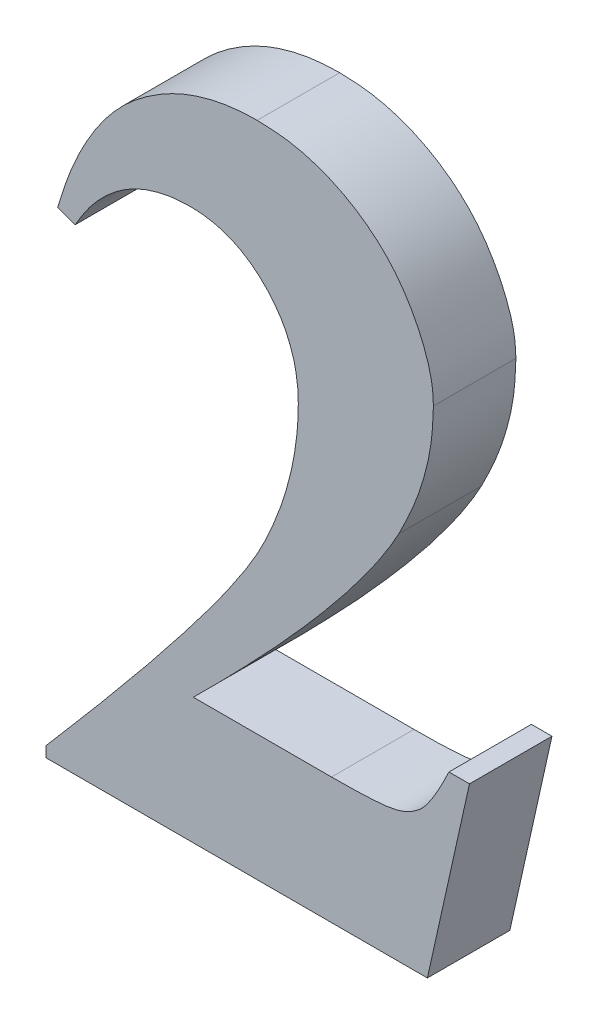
ISO-10303-21;
HEADER;
FILE_DESCRIPTION(('STEP AP214'),'2;1');
FILE_NAME('part.step','',(''),(''),'','','');
FILE_SCHEMA(('AUTOMOTIVE_DESIGN { 1 0 10303 214 1 1 1 1 }'));
ENDSEC;
DATA;
#1=APPLICATION_CONTEXT('core data for automotive mechanical design processes');
#2=APPLICATION_PROTOCOL_DEFINITION('international standard','automotive_design',2000,#1);
#3=PRODUCT_CONTEXT('',#1,'mechanical');
#4=PRODUCT('Part','Part','',(#3));
#5=PRODUCT_RELATED_PRODUCT_CATEGORY('part','',(#4));
#6=PRODUCT_DEFINITION_FORMATION('','',#4);
#7=PRODUCT_DEFINITION_CONTEXT('part definition',#1,'design');
#8=PRODUCT_DEFINITION('design','',#6,#7);
#9=PRODUCT_DEFINITION_SHAPE('','',#8);
#10=(LENGTH_UNIT() NAMED_UNIT(*) SI_UNIT(.MILLI.,.METRE.));
#11=(NAMED_UNIT(*) PLANE_ANGLE_UNIT() SI_UNIT($,.RADIAN.));
#12=(NAMED_UNIT(*) SI_UNIT($,.STERADIAN.) SOLID_ANGLE_UNIT());
#13=UNCERTAINTY_MEASURE_WITH_UNIT(LENGTH_MEASURE(1.E-05),#10,'distance_accuracy_value','');
#14=(GEOMETRIC_REPRESENTATION_CONTEXT(3) GLOBAL_UNCERTAINTY_ASSIGNED_CONTEXT((#13)) GLOBAL_UNIT_ASSIGNED_CONTEXT((#10,
#11,#12)) REPRESENTATION_CONTEXT('',''));
#15=CARTESIAN_POINT('',(0.,0.,0.));
#16=DIRECTION('',(0.,0.,1.));
#17=DIRECTION('',(1.,0.,0.));
#18=AXIS2_PLACEMENT_3D('',#15,#16,#17);
#19=CARTESIAN_POINT('',(-28.575,0.,-6.35));
#20=DIRECTION('',(0.,-1.,0.));
#21=DIRECTION('',(0.,0.,-1.));
#22=AXIS2_PLACEMENT_3D('',#19,#20,#21);
#23=PLANE('',#22);
#24=DIRECTION('',(0.,0.,1.));
#25=VECTOR('',#24,1.);
#26=CARTESIAN_POINT('',(2.16972041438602,0.,-6.35));
#27=LINE('',#26,#25);
#28=CARTESIAN_POINT('',(2.16972041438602,0.,-6.35));
#29=VERTEX_POINT('',#28);
#30=CARTESIAN_POINT('',(2.16972041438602,0.,0.));
#31=VERTEX_POINT('',#30);
#32=EDGE_CURVE('E131',#29,#31,#27,.T.);
#33=ORIENTED_EDGE('',*,*,#32,.T.);
#34=DIRECTION('',(1.,0.,0.));
#35=VECTOR('',#34,1.);
#36=CARTESIAN_POINT('',(-28.575,0.,0.));
#37=LINE('',#36,#35);
#38=CARTESIAN_POINT('',(-27.1878571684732,0.,0.));
#39=VERTEX_POINT('',#38);
#40=EDGE_CURVE('E36',#39,#31,#37,.T.);
#41=ORIENTED_EDGE('',*,*,#40,.F.);
#42=DIRECTION('',(0.,0.,1.));
#43=VECTOR('',#42,1.);
#44=CARTESIAN_POINT('',(-27.1878571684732,0.,-6.35));
#45=LINE('',#44,#43);
#46=CARTESIAN_POINT('',(-27.1878571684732,0.,-6.35));
#47=VERTEX_POINT('',#46);
#48=EDGE_CURVE('E144',#47,#39,#45,.T.);
#49=ORIENTED_EDGE('',*,*,#48,.F.);
#50=DIRECTION('',(1.,0.,0.));
#51=VECTOR('',#50,1.);
#52=CARTESIAN_POINT('',(-28.575,0.,-6.35));
#53=LINE('',#52,#51);
#54=EDGE_CURVE('E11',#47,#29,#53,.T.);
#55=ORIENTED_EDGE('',*,*,#54,.T.);
#56=EDGE_LOOP('',(#33,#41,#49,#55));
#57=FACE_BOUND('',#56,.T.);
#58=ADVANCED_FACE('F29',(#57),#23,.T.);
#59=CARTESIAN_POINT('',(-28.575,57.15,-6.35));
#60=DIRECTION('',(0.,0.,1.));
#61=DIRECTION('',(1.,0.,0.));
#62=AXIS2_PLACEMENT_3D('',#59,#60,#61);
#63=PLANE('',#62);
#64=DIRECTION('',(1.,0.,0.));
#65=VECTOR('',#64,1.);
#66=CARTESIAN_POINT('',(3.82778958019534,14.5649997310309,-6.35));
#67=LINE('',#66,#65);
#68=CARTESIAN_POINT('',(3.82778958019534,14.5649997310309,-6.35));
#69=VERTEX_POINT('',#68);
#70=CARTESIAN_POINT('',(5.40999937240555,14.5649997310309,-6.35));
#71=VERTEX_POINT('',#70);
#72=EDGE_CURVE('E174',#69,#71,#67,.T.);
#73=ORIENTED_EDGE('',*,*,#72,.T.);
#74=DIRECTION('',(-0.217161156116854,-0.976135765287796,0.));
#75=VECTOR('',#74,1.);
#76=CARTESIAN_POINT('',(5.40999937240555,14.5649997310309,-6.35));
#77=LINE('',#76,#75);
#78=EDGE_CURVE('E297',#71,#29,#77,.T.);
#79=ORIENTED_EDGE('',*,*,#78,.T.);
#80=ORIENTED_EDGE('',*,*,#54,.F.);
#81=DIRECTION('',(0.,1.,0.));
#82=VECTOR('',#81,1.);
#83=CARTESIAN_POINT('',(-27.1878571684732,0.,-6.35));
#84=LINE('',#83,#82);
#85=CARTESIAN_POINT('',(-27.1878571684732,0.812779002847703,-6.35));
#86=VERTEX_POINT('',#85);
#87=EDGE_CURVE('E300',#47,#86,#84,.T.);
#88=ORIENTED_EDGE('',*,*,#87,.T.);
#89=CARTESIAN_POINT('',(-27.1878571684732,0.812779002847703,-6.35));
#90=CARTESIAN_POINT('',(-26.6239457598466,1.46989620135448,-6.35));
#91=CARTESIAN_POINT('',(-25.5226560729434,2.75321195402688,-6.35));
#92=CARTESIAN_POINT('',(-23.9151617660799,4.63946114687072,-6.35));
#93=CARTESIAN_POINT('',(-22.4010764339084,6.44830604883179,-6.35));
#94=CARTESIAN_POINT('',(-20.9705572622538,8.17138959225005,-6.35));
#95=CARTESIAN_POINT('',(-19.6225294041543,9.80802042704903,-6.35));
#96=CARTESIAN_POINT('',(-18.3693298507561,11.3681607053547,-6.35));
#97=CARTESIAN_POINT('',(-17.1939883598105,12.8418172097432,-6.35));
#98=CARTESIAN_POINT('',(-16.1143963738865,14.2394748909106,-6.35));
#99=CARTESIAN_POINT('',(-15.1114901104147,15.5500996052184,-6.35));
#100=CARTESIAN_POINT('',(-14.2094766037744,16.7844955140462,-6.35));
#101=CARTESIAN_POINT('',(-13.372605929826,17.924008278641,-6.35));
#102=CARTESIAN_POINT('',(-12.6472391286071,18.9942571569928,-6.35));
#103=CARTESIAN_POINT('',(-11.9833837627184,19.9718561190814,-6.35));
#104=CARTESIAN_POINT('',(-11.4298463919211,20.8780577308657,-6.35));
#105=CARTESIAN_POINT('',(-10.9429017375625,21.692754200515,-6.35));
#106=CARTESIAN_POINT('',(-10.4295500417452,22.6691619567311,-6.35));
#107=CARTESIAN_POINT('',(-9.88741223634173,23.8341140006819,-6.35));
#108=CARTESIAN_POINT('',(-9.32117474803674,25.2112785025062,-6.35));
#109=CARTESIAN_POINT('',(-8.84073295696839,26.5815205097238,-6.35));
#110=CARTESIAN_POINT('',(-8.45122547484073,27.9459956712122,-6.35));
#111=CARTESIAN_POINT('',(-8.14571768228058,29.3027174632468,-6.35));
#112=CARTESIAN_POINT('',(-7.92928429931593,30.6489684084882,-6.35));
#113=CARTESIAN_POINT('',(-7.79290503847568,31.9881557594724,-6.35));
#114=CARTESIAN_POINT('',(-7.77619497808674,32.879302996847,-6.35));
#115=CARTESIAN_POINT('',(-7.76785752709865,33.3239391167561,-6.35));
#116=B_SPLINE_CURVE_WITH_KNOTS('',3,(#89,#90,#91,#92,#93,#94,#95,#96,#97,#98,#99,#100,#101,#102,
#103,#104,#105,#106,#107,#108,#109,#110,#111,#112,#113,#114,#115),.UNSPECIFIED.,.F.,.F.,(4,1,1,
1,1,1,1,1,1,1,1,1,1,1,1,1,1,1,1,1,1,1,1,1,4),(0.,0.0671915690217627,0.131221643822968,
0.19230578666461,0.250231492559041,0.305000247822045,0.356831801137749,0.405511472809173,
0.45126317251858,0.493870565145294,0.533563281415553,0.569896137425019,0.603562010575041,
0.633881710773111,0.661573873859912,0.685947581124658,0.707514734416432,0.747140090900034,
0.785607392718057,0.823017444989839,0.859749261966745,0.895655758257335,0.930862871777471,
0.965504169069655,1.),.UNSPECIFIED.);
#117=CARTESIAN_POINT('',(-7.76785752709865,33.3239391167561,-6.35));
#118=VERTEX_POINT('',#117);
#119=EDGE_CURVE('E303',#86,#118,#116,.T.);
#120=ORIENTED_EDGE('',*,*,#119,.T.);
#121=CARTESIAN_POINT('',(-7.76785752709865,33.3239391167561,-6.35));
#122=CARTESIAN_POINT('',(-7.77181152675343,33.6387144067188,-6.35));
#123=CARTESIAN_POINT('',(-7.77961348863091,34.2598234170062,-6.35));
#124=CARTESIAN_POINT('',(-7.90980681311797,35.1680345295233,-6.35));
#125=CARTESIAN_POINT('',(-8.08364680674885,36.042674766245,-6.35));
#126=CARTESIAN_POINT('',(-8.36284810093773,36.8661025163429,-6.35));
#127=CARTESIAN_POINT('',(-8.69603394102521,37.6528799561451,-6.35));
#128=CARTESIAN_POINT('',(-9.1124071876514,38.3988228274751,-6.35));
#129=CARTESIAN_POINT('',(-9.61297999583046,39.0979005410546,-6.35));
#130=CARTESIAN_POINT('',(-10.1712436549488,39.7580585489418,-6.35));
#131=CARTESIAN_POINT('',(-10.7878013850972,40.3497819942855,-6.35));
#132=CARTESIAN_POINT('',(-11.4410960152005,40.8770174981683,-6.35));
#133=CARTESIAN_POINT('',(-12.1320606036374,41.3193237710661,-6.35));
#134=CARTESIAN_POINT('',(-12.8583863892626,41.6828927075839,-6.35));
#135=CARTESIAN_POINT('',(-13.6137769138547,41.9646718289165,-6.35));
#136=CARTESIAN_POINT('',(-14.4067089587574,42.1597612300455,-6.35));
#137=CARTESIAN_POINT('',(-15.2308221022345,42.2814995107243,-6.35));
#138=CARTESIAN_POINT('',(-15.7940778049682,42.2989844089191,-6.35));
#139=CARTESIAN_POINT('',(-16.0798774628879,42.3078563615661,-6.35));
#140=B_SPLINE_CURVE_WITH_KNOTS('',3,(#121,#122,#123,#124,#125,#126,#127,#128,#129,#130,#131,
#132,#133,#134,#135,#136,#137,#138,#139),.UNSPECIFIED.,.F.,.F.,(4,1,1,1,1,1,1,1,1,1,1,1,1,1,1,1,
4),(0.,0.0690744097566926,0.13629639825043,0.20119277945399,0.264676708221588,0.326878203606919,
0.388688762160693,0.45187445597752,0.515477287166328,0.578328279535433,0.639297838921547,
0.699608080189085,0.758159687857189,0.817411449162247,0.876300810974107,0.937234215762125,1.),.UNSPECIFIED.);
#141=CARTESIAN_POINT('',(-16.0798774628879,42.3078563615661,-6.35));
#142=VERTEX_POINT('',#141);
#143=EDGE_CURVE('E262',#118,#142,#140,.T.);
#144=ORIENTED_EDGE('',*,*,#143,.T.);
#145=CARTESIAN_POINT('',(-16.0798774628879,42.3078563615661,-6.35));
#146=CARTESIAN_POINT('',(-16.5437869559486,42.2931717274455,-6.35));
#147=CARTESIAN_POINT('',(-17.4546262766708,42.2643399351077,-6.35));
#148=CARTESIAN_POINT('',(-18.7729737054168,41.9791444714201,-6.35));
#149=CARTESIAN_POINT('',(-20.0184136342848,41.5487057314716,-6.35));
#150=CARTESIAN_POINT('',(-21.1796436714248,40.9203769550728,-6.35));
#151=CARTESIAN_POINT('',(-22.2541075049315,40.1107743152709,-6.35));
#152=CARTESIAN_POINT('',(-23.2515114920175,39.1309739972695,-6.35));
#153=CARTESIAN_POINT('',(-24.1673565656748,37.9778010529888,-6.35));
#154=CARTESIAN_POINT('',(-24.6803081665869,37.1092432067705,-6.35));
#155=CARTESIAN_POINT('',(-24.9445871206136,36.6617515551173,-6.35));
#156=B_SPLINE_CURVE_WITH_KNOTS('',3,(#145,#146,#147,#148,#149,#150,#151,#152,#153,#154,#155),
.UNSPECIFIED.,.F.,.F.,(4,1,1,1,1,1,1,1,4),(0.,0.125501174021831,0.246408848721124,
0.363710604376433,0.481484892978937,0.602436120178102,0.726995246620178,0.859344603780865,1.),.UNSPECIFIED.);
#157=CARTESIAN_POINT('',(-24.9445871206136,36.6617515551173,-6.35));
#158=VERTEX_POINT('',#157);
#159=EDGE_CURVE('E256',#142,#158,#156,.T.);
#160=ORIENTED_EDGE('',*,*,#159,.T.);
#161=DIRECTION('',(-0.943268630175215,0.332030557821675,0.));
#162=VECTOR('',#161,1.);
#163=CARTESIAN_POINT('',(-24.9445871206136,36.6617515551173,-6.35));
#164=LINE('',#163,#162);
#165=CARTESIAN_POINT('',(-26.2992187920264,37.1385819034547,-6.35));
#166=VERTEX_POINT('',#165);
#167=EDGE_CURVE('E261',#158,#166,#164,.T.);
#168=ORIENTED_EDGE('',*,*,#167,.T.);
#169=CARTESIAN_POINT('',(-26.2992187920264,37.1385819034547,-6.35));
#170=CARTESIAN_POINT('',(-26.1280410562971,37.6967918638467,-6.35));
#171=CARTESIAN_POINT('',(-25.7949552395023,38.7829834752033,-6.35));
#172=CARTESIAN_POINT('',(-25.2098884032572,40.3428300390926,-6.35));
#173=CARTESIAN_POINT('',(-24.5476253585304,41.7860810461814,-6.35));
#174=CARTESIAN_POINT('',(-23.8238938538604,43.1189679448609,-6.35));
#175=CARTESIAN_POINT('',(-23.0410159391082,44.3419468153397,-6.35));
#176=CARTESIAN_POINT('',(-22.1946526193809,45.4561365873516,-6.35));
#177=CARTESIAN_POINT('',(-21.2740297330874,46.4513580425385,-6.35));
#178=CARTESIAN_POINT('',(-20.2936892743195,47.335562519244,-6.35));
#179=CARTESIAN_POINT('',(-19.259080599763,48.1050964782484,-6.35));
#180=CARTESIAN_POINT('',(-18.1833025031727,48.7803351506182,-6.35));
#181=CARTESIAN_POINT('',(-17.0678452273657,49.3559392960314,-6.35));
#182=CARTESIAN_POINT('',(-15.9146535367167,49.8249344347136,-6.35));
#183=CARTESIAN_POINT('',(-14.7236499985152,50.1823991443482,-6.35));
#184=CARTESIAN_POINT('',(-13.495732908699,50.4453029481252,-6.35));
#185=CARTESIAN_POINT('',(-12.2256952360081,50.5970784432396,-6.35));
#186=CARTESIAN_POINT('',(-11.3661493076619,50.6194306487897,-6.35));
#187=CARTESIAN_POINT('',(-10.9322771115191,50.6307133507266,-6.35));
#188=B_SPLINE_CURVE_WITH_KNOTS('',3,(#169,#170,#171,#172,#173,#174,#175,#176,#177,#178,#179,
#180,#181,#182,#183,#184,#185,#186,#187),.UNSPECIFIED.,.F.,.F.,(4,1,1,1,1,1,1,1,1,1,1,1,1,1,1,1,
4),(0.,0.0791525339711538,0.154018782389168,0.225684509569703,0.29428552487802,
0.359498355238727,0.422389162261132,0.483737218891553,0.543041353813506,0.601129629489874,
0.65834200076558,0.71507647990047,0.771102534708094,0.826881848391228,0.883461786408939,
0.941175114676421,1.),.UNSPECIFIED.);
#189=CARTESIAN_POINT('',(-10.9322771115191,50.6307133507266,-6.35));
#190=VERTEX_POINT('',#189);
#191=EDGE_CURVE('E228',#166,#190,#188,.T.);
#192=ORIENTED_EDGE('',*,*,#191,.T.);
#193=CARTESIAN_POINT('',(-10.9322771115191,50.6307133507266,-6.35));
#194=CARTESIAN_POINT('',(-10.3132096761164,50.6101527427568,-6.35));
#195=CARTESIAN_POINT('',(-9.09159423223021,50.5695801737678,-6.35));
#196=CARTESIAN_POINT('',(-7.30372566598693,50.2398511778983,-6.35));
#197=CARTESIAN_POINT('',(-5.60460590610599,49.6785977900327,-6.35));
#198=CARTESIAN_POINT('',(-4.00696284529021,48.9112031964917,-6.35));
#199=CARTESIAN_POINT('',(-2.5308944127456,47.9585193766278,-6.35));
#200=CARTESIAN_POINT('',(-1.20773561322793,46.8364208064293,-6.35));
#201=CARTESIAN_POINT('',(-0.0575656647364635,45.545594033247,-6.35));
#202=CARTESIAN_POINT('',(0.886785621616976,44.1154872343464,-6.35));
#203=CARTESIAN_POINT('',(1.64869759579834,42.6406257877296,-6.35));
#204=CARTESIAN_POINT('',(2.20804648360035,41.1809425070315,-6.35));
#205=CARTESIAN_POINT('',(2.57023426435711,39.7642847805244,-6.35));
#206=CARTESIAN_POINT('',(2.61435537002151,38.827492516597,-6.35));
#207=CARTESIAN_POINT('',(2.63571370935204,38.3740059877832,-6.35));
#208=B_SPLINE_CURVE_WITH_KNOTS('',3,(#193,#194,#195,#196,#197,#198,#199,#200,#201,#202,#203,
#204,#205,#206,#207),.UNSPECIFIED.,.F.,.F.,(4,1,1,1,1,1,1,1,1,1,1,1,4),(0.,0.0920022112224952,
0.181549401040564,0.269191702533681,0.357357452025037,0.444362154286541,0.529709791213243,
0.614547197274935,0.700501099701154,0.783856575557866,0.86086543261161,0.932647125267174,1.),.UNSPECIFIED.);
#209=CARTESIAN_POINT('',(2.63571370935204,38.3740059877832,-6.35));
#210=VERTEX_POINT('',#209);
#211=EDGE_CURVE('E219',#190,#210,#208,.T.);
#212=ORIENTED_EDGE('',*,*,#211,.T.);
#213=CARTESIAN_POINT('',(2.63571370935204,38.3740059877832,-6.35));
#214=CARTESIAN_POINT('',(2.60458623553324,37.5622754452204,-6.35));
#215=CARTESIAN_POINT('',(2.54148104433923,35.9166420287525,-6.35));
#216=CARTESIAN_POINT('',(2.01038212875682,33.4492142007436,-6.35));
#217=CARTESIAN_POINT('',(1.17841356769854,30.9592383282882,-6.35));
#218=CARTESIAN_POINT('',(0.386844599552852,29.3564588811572,-6.35));
#219=CARTESIAN_POINT('',(-0.0193643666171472,28.5339615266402,-6.35));
#220=B_SPLINE_CURVE_WITH_KNOTS('',3,(#213,#214,#215,#216,#217,#218,#219),.UNSPECIFIED.,.F.,.F.,
(4,1,1,1,4),(0.,0.236452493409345,0.479363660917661,0.732825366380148,1.),.UNSPECIFIED.);
#221=CARTESIAN_POINT('',(-0.0193643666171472,28.5339615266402,-6.35));
#222=VERTEX_POINT('',#221);
#223=EDGE_CURVE('E210',#210,#222,#220,.T.);
#224=ORIENTED_EDGE('',*,*,#223,.T.);
#225=CARTESIAN_POINT('',(-0.0193643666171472,28.5339615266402,-6.35));
#226=CARTESIAN_POINT('',(-0.179344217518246,28.243464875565,-6.35));
#227=CARTESIAN_POINT('',(-0.509114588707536,27.6446570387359,-6.35));
#228=CARTESIAN_POINT('',(-1.07265916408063,26.7439063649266,-6.35));
#229=CARTESIAN_POINT('',(-1.68221620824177,25.7892316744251,-6.35));
#230=CARTESIAN_POINT('',(-2.38217096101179,24.8055429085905,-6.35));
#231=CARTESIAN_POINT('',(-3.14218370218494,23.7797060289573,-6.35));
#232=CARTESIAN_POINT('',(-3.95223392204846,22.695947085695,-6.35));
#233=CARTESIAN_POINT('',(-4.85673947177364,21.5920010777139,-6.35));
#234=CARTESIAN_POINT('',(-5.80459533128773,20.4281660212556,-6.35));
#235=CARTESIAN_POINT('',(-6.83175721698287,19.2326432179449,-6.35));
#236=CARTESIAN_POINT('',(-7.92000792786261,17.9943292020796,-6.35));
#237=CARTESIAN_POINT('',(-9.07246922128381,16.7085835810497,-6.35));
#238=CARTESIAN_POINT('',(-10.2979702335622,15.3870270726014,-6.35));
#239=CARTESIAN_POINT('',(-11.5943808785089,14.0280242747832,-6.35));
#240=CARTESIAN_POINT('',(-12.9570067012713,12.6270519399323,-6.35));
#241=CARTESIAN_POINT('',(-14.369170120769,11.1710305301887,-6.35));
#242=CARTESIAN_POINT('',(-15.3518663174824,10.2029764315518,-6.35));
#243=CARTESIAN_POINT('',(-15.8522993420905,9.70999982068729,-6.35));
#244=B_SPLINE_CURVE_WITH_KNOTS('',3,(#225,#226,#227,#228,#229,#230,#231,#232,#233,#234,#235,
#236,#237,#238,#239,#240,#241,#242,#243),.UNSPECIFIED.,.F.,.F.,(4,1,1,1,1,1,1,1,1,1,1,1,1,1,1,1,
4),(0.,0.0403203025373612,0.0831132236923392,0.129170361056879,0.17804083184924,
0.229877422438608,0.2844363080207,0.342543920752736,0.403400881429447,0.466961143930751,
0.534194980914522,0.603872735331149,0.676921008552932,0.753355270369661,0.832261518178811,
0.914580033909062,1.),.UNSPECIFIED.);
#245=CARTESIAN_POINT('',(-15.8522993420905,9.70999982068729,-6.35));
#246=VERTEX_POINT('',#245);
#247=EDGE_CURVE('E205',#222,#246,#244,.T.);
#248=ORIENTED_EDGE('',*,*,#247,.T.);
#249=DIRECTION('',(1.,0.,0.));
#250=VECTOR('',#249,1.);
#251=CARTESIAN_POINT('',(-15.8522993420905,9.70999982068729,-6.35));
#252=LINE('',#251,#250);
#253=CARTESIAN_POINT('',(-5.21031293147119,9.70999982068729,-6.35));
#254=VERTEX_POINT('',#253);
#255=EDGE_CURVE('E183',#246,#254,#252,.T.);
#256=ORIENTED_EDGE('',*,*,#255,.T.);
#257=CARTESIAN_POINT('',(-5.21031293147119,9.70999982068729,-6.35));
#258=CARTESIAN_POINT('',(-4.89600078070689,9.70755275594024,-6.35));
#259=CARTESIAN_POINT('',(-4.29979890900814,9.70291104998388,-6.35));
#260=CARTESIAN_POINT('',(-3.44756825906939,9.73405401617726,-6.35));
#261=CARTESIAN_POINT('',(-2.6809767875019,9.74488728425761,-6.35));
#262=CARTESIAN_POINT('',(-2.00234758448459,9.79484685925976,-6.35));
#263=CARTESIAN_POINT('',(-1.40957942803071,9.83592157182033,-6.35));
#264=CARTESIAN_POINT('',(-0.901725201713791,9.88285977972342,-6.35));
#265=CARTESIAN_POINT('',(-0.480340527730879,9.96309291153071,-6.35));
#266=CARTESIAN_POINT('',(0.152189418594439,10.0978624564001,-6.35));
#267=CARTESIAN_POINT('',(0.961646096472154,10.4505864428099,-6.35));
#268=CARTESIAN_POINT('',(1.74592123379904,11.051176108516,-6.35));
#269=CARTESIAN_POINT('',(2.28821852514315,11.7469802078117,-6.35));
#270=CARTESIAN_POINT('',(2.75627213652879,12.4864096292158,-6.35));
#271=CARTESIAN_POINT('',(3.28744188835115,13.4457664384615,-6.35));
#272=CARTESIAN_POINT('',(3.6367201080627,14.1692336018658,-6.35));
#273=CARTESIAN_POINT('',(3.82778958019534,14.5649997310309,-6.35));
#274=B_SPLINE_CURVE_WITH_KNOTS('',3,(#257,#258,#259,#260,#261,#262,#263,#264,#265,#266,#267,
#268,#269,#270,#271,#272,#273),.UNSPECIFIED.,.F.,.F.,(4,1,1,1,1,1,1,1,1,1,1,1,1,1,4),(0.,
0.0832403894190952,0.157894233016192,0.225852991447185,0.286251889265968,0.338059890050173,
0.383282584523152,0.421193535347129,0.451600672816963,0.554494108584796,0.651921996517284,
0.709750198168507,0.787243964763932,0.88361374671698,1.),.UNSPECIFIED.);
#275=EDGE_CURVE('E177',#254,#69,#274,.T.);
#276=ORIENTED_EDGE('',*,*,#275,.T.);
#277=EDGE_LOOP('',(#73,#79,#80,#88,#120,#144,#160,#168,#192,#212,#224,#248,#256,#276));
#278=FACE_BOUND('',#277,.T.);
#279=ADVANCED_FACE('F275',(#278),#63,.F.);
#280=CARTESIAN_POINT('',(-28.575,57.15,0.));
#281=DIRECTION('',(0.,0.,1.));
#282=DIRECTION('',(1.,0.,0.));
#283=AXIS2_PLACEMENT_3D('',#280,#281,#282);
#284=PLANE('',#283);
#285=DIRECTION('',(-0.217161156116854,-0.976135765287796,0.));
#286=VECTOR('',#285,1.);
#287=CARTESIAN_POINT('',(5.40999937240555,14.5649997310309,0.));
#288=LINE('',#287,#286);
#289=CARTESIAN_POINT('',(5.40999937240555,14.5649997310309,0.));
#290=VERTEX_POINT('',#289);
#291=EDGE_CURVE('E127',#290,#31,#288,.T.);
#292=ORIENTED_EDGE('',*,*,#291,.F.);
#293=DIRECTION('',(1.,0.,0.));
#294=VECTOR('',#293,1.);
#295=CARTESIAN_POINT('',(3.82778958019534,14.5649997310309,0.));
#296=LINE('',#295,#294);
#297=CARTESIAN_POINT('',(3.82778958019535,14.5649997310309,0.));
#298=VERTEX_POINT('',#297);
#299=EDGE_CURVE('E299',#298,#290,#296,.T.);
#300=ORIENTED_EDGE('',*,*,#299,.F.);
#301=CARTESIAN_POINT('',(-5.21031293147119,9.70999982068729,0.));
#302=CARTESIAN_POINT('',(-4.89600078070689,9.70755275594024,0.));
#303=CARTESIAN_POINT('',(-4.29979890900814,9.70291104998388,0.));
#304=CARTESIAN_POINT('',(-3.44756825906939,9.73405401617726,0.));
#305=CARTESIAN_POINT('',(-2.6809767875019,9.74488728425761,0.));
#306=CARTESIAN_POINT('',(-2.00234758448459,9.79484685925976,0.));
#307=CARTESIAN_POINT('',(-1.40957942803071,9.83592157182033,0.));
#308=CARTESIAN_POINT('',(-0.901725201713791,9.88285977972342,0.));
#309=CARTESIAN_POINT('',(-0.480340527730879,9.96309291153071,0.));
#310=CARTESIAN_POINT('',(0.152189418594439,10.0978624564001,0.));
#311=CARTESIAN_POINT('',(0.961646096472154,10.4505864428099,0.));
#312=CARTESIAN_POINT('',(1.74592123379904,11.051176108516,0.));
#313=CARTESIAN_POINT('',(2.28821852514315,11.7469802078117,0.));
#314=CARTESIAN_POINT('',(2.75627213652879,12.4864096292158,0.));
#315=CARTESIAN_POINT('',(3.28744188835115,13.4457664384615,0.));
#316=CARTESIAN_POINT('',(3.6367201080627,14.1692336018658,0.));
#317=CARTESIAN_POINT('',(3.82778958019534,14.5649997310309,0.));
#318=B_SPLINE_CURVE_WITH_KNOTS('',3,(#301,#302,#303,#304,#305,#306,#307,#308,#309,#310,#311,
#312,#313,#314,#315,#316,#317),.UNSPECIFIED.,.F.,.F.,(4,1,1,1,1,1,1,1,1,1,1,1,1,1,4),(0.,
0.0832403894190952,0.157894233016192,0.225852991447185,0.286251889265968,0.338059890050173,
0.383282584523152,0.421193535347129,0.451600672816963,0.554494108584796,0.651921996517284,
0.709750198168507,0.787243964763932,0.88361374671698,1.),.UNSPECIFIED.);
#319=CARTESIAN_POINT('',(-5.21031293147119,9.70999982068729,0.));
#320=VERTEX_POINT('',#319);
#321=EDGE_CURVE('E43',#320,#298,#318,.T.);
#322=ORIENTED_EDGE('',*,*,#321,.F.);
#323=DIRECTION('',(1.,0.,0.));
#324=VECTOR('',#323,1.);
#325=CARTESIAN_POINT('',(-15.8522993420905,9.70999982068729,0.));
#326=LINE('',#325,#324);
#327=CARTESIAN_POINT('',(-15.8522993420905,9.70999982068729,0.));
#328=VERTEX_POINT('',#327);
#329=EDGE_CURVE('E296',#328,#320,#326,.T.);
#330=ORIENTED_EDGE('',*,*,#329,.F.);
#331=CARTESIAN_POINT('',(-0.0193643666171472,28.5339615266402,0.));
#332=CARTESIAN_POINT('',(-0.179344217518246,28.243464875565,0.));
#333=CARTESIAN_POINT('',(-0.509114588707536,27.6446570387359,0.));
#334=CARTESIAN_POINT('',(-1.07265916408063,26.7439063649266,0.));
#335=CARTESIAN_POINT('',(-1.68221620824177,25.7892316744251,0.));
#336=CARTESIAN_POINT('',(-2.38217096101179,24.8055429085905,0.));
#337=CARTESIAN_POINT('',(-3.14218370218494,23.7797060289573,0.));
#338=CARTESIAN_POINT('',(-3.95223392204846,22.695947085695,0.));
#339=CARTESIAN_POINT('',(-4.85673947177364,21.5920010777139,0.));
#340=CARTESIAN_POINT('',(-5.80459533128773,20.4281660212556,0.));
#341=CARTESIAN_POINT('',(-6.83175721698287,19.2326432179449,0.));
#342=CARTESIAN_POINT('',(-7.92000792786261,17.9943292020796,0.));
#343=CARTESIAN_POINT('',(-9.07246922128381,16.7085835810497,0.));
#344=CARTESIAN_POINT('',(-10.2979702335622,15.3870270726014,0.));
#345=CARTESIAN_POINT('',(-11.5943808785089,14.0280242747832,0.));
#346=CARTESIAN_POINT('',(-12.9570067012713,12.6270519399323,0.));
#347=CARTESIAN_POINT('',(-14.369170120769,11.1710305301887,0.));
#348=CARTESIAN_POINT('',(-15.3518663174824,10.2029764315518,0.));
#349=CARTESIAN_POINT('',(-15.8522993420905,9.70999982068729,0.));
#350=B_SPLINE_CURVE_WITH_KNOTS('',3,(#331,#332,#333,#334,#335,#336,#337,#338,#339,#340,#341,
#342,#343,#344,#345,#346,#347,#348,#349),.UNSPECIFIED.,.F.,.F.,(4,1,1,1,1,1,1,1,1,1,1,1,1,1,1,1,
4),(0.,0.0403203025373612,0.0831132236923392,0.129170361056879,0.17804083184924,
0.229877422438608,0.2844363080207,0.342543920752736,0.403400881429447,0.466961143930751,
0.534194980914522,0.603872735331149,0.676921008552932,0.753355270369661,0.832261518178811,
0.914580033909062,1.),.UNSPECIFIED.);
#351=CARTESIAN_POINT('',(-0.0193643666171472,28.5339615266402,0.));
#352=VERTEX_POINT('',#351);
#353=EDGE_CURVE('E293',#352,#328,#350,.T.);
#354=ORIENTED_EDGE('',*,*,#353,.F.);
#355=CARTESIAN_POINT('',(2.63571370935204,38.3740059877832,0.));
#356=CARTESIAN_POINT('',(2.60458623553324,37.5622754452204,0.));
#357=CARTESIAN_POINT('',(2.54148104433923,35.9166420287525,0.));
#358=CARTESIAN_POINT('',(2.01038212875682,33.4492142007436,0.));
#359=CARTESIAN_POINT('',(1.17841356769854,30.9592383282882,0.));
#360=CARTESIAN_POINT('',(0.386844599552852,29.3564588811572,0.));
#361=CARTESIAN_POINT('',(-0.0193643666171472,28.5339615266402,0.));
#362=B_SPLINE_CURVE_WITH_KNOTS('',3,(#355,#356,#357,#358,#359,#360,#361),.UNSPECIFIED.,.F.,.F.,
(4,1,1,1,4),(0.,0.236452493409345,0.479363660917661,0.732825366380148,1.),.UNSPECIFIED.);
#363=CARTESIAN_POINT('',(2.63571370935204,38.3740059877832,0.));
#364=VERTEX_POINT('',#363);
#365=EDGE_CURVE('E460',#364,#352,#362,.T.);
#366=ORIENTED_EDGE('',*,*,#365,.F.);
#367=CARTESIAN_POINT('',(-10.9322771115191,50.6307133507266,0.));
#368=CARTESIAN_POINT('',(-10.3132096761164,50.6101527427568,0.));
#369=CARTESIAN_POINT('',(-9.09159423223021,50.5695801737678,0.));
#370=CARTESIAN_POINT('',(-7.30372566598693,50.2398511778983,0.));
#371=CARTESIAN_POINT('',(-5.60460590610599,49.6785977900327,0.));
#372=CARTESIAN_POINT('',(-4.00696284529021,48.9112031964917,0.));
#373=CARTESIAN_POINT('',(-2.5308944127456,47.9585193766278,0.));
#374=CARTESIAN_POINT('',(-1.20773561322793,46.8364208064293,0.));
#375=CARTESIAN_POINT('',(-0.0575656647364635,45.545594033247,0.));
#376=CARTESIAN_POINT('',(0.886785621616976,44.1154872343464,0.));
#377=CARTESIAN_POINT('',(1.64869759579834,42.6406257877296,0.));
#378=CARTESIAN_POINT('',(2.20804648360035,41.1809425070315,0.));
#379=CARTESIAN_POINT('',(2.57023426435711,39.7642847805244,0.));
#380=CARTESIAN_POINT('',(2.61435537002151,38.827492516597,0.));
#381=CARTESIAN_POINT('',(2.63571370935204,38.3740059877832,0.));
#382=B_SPLINE_CURVE_WITH_KNOTS('',3,(#367,#368,#369,#370,#371,#372,#373,#374,#375,#376,#377,
#378,#379,#380,#381),.UNSPECIFIED.,.F.,.F.,(4,1,1,1,1,1,1,1,1,1,1,1,4),(0.,0.0920022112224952,
0.181549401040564,0.269191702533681,0.357357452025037,0.444362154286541,0.529709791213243,
0.614547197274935,0.700501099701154,0.783856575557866,0.86086543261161,0.932647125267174,1.),.UNSPECIFIED.);
#383=CARTESIAN_POINT('',(-10.9322771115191,50.6307133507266,0.));
#384=VERTEX_POINT('',#383);
#385=EDGE_CURVE('E284',#384,#364,#382,.T.);
#386=ORIENTED_EDGE('',*,*,#385,.F.);
#387=CARTESIAN_POINT('',(-26.2992187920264,37.1385819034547,0.));
#388=CARTESIAN_POINT('',(-26.1280410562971,37.6967918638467,0.));
#389=CARTESIAN_POINT('',(-25.7949552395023,38.7829834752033,0.));
#390=CARTESIAN_POINT('',(-25.2098884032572,40.3428300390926,0.));
#391=CARTESIAN_POINT('',(-24.5476253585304,41.7860810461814,0.));
#392=CARTESIAN_POINT('',(-23.8238938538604,43.1189679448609,0.));
#393=CARTESIAN_POINT('',(-23.0410159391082,44.3419468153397,0.));
#394=CARTESIAN_POINT('',(-22.1946526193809,45.4561365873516,0.));
#395=CARTESIAN_POINT('',(-21.2740297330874,46.4513580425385,0.));
#396=CARTESIAN_POINT('',(-20.2936892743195,47.335562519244,0.));
#397=CARTESIAN_POINT('',(-19.259080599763,48.1050964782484,0.));
#398=CARTESIAN_POINT('',(-18.1833025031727,48.7803351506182,0.));
#399=CARTESIAN_POINT('',(-17.0678452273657,49.3559392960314,0.));
#400=CARTESIAN_POINT('',(-15.9146535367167,49.8249344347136,0.));
#401=CARTESIAN_POINT('',(-14.7236499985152,50.1823991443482,0.));
#402=CARTESIAN_POINT('',(-13.495732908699,50.4453029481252,0.));
#403=CARTESIAN_POINT('',(-12.2256952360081,50.5970784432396,0.));
#404=CARTESIAN_POINT('',(-11.3661493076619,50.6194306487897,0.));
#405=CARTESIAN_POINT('',(-10.9322771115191,50.6307133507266,0.));
#406=B_SPLINE_CURVE_WITH_KNOTS('',3,(#387,#388,#389,#390,#391,#392,#393,#394,#395,#396,#397,
#398,#399,#400,#401,#402,#403,#404,#405),.UNSPECIFIED.,.F.,.F.,(4,1,1,1,1,1,1,1,1,1,1,1,1,1,1,1,
4),(0.,0.0791525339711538,0.154018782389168,0.225684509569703,0.29428552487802,
0.359498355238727,0.422389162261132,0.483737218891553,0.543041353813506,0.601129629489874,
0.65834200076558,0.71507647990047,0.771102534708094,0.826881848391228,0.883461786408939,
0.941175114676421,1.),.UNSPECIFIED.);
#407=CARTESIAN_POINT('',(-26.2992187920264,37.1385819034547,0.));
#408=VERTEX_POINT('',#407);
#409=EDGE_CURVE('E280',#408,#384,#406,.T.);
#410=ORIENTED_EDGE('',*,*,#409,.F.);
#411=DIRECTION('',(-0.943268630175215,0.332030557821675,0.));
#412=VECTOR('',#411,1.);
#413=CARTESIAN_POINT('',(-24.9445871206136,36.6617515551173,0.));
#414=LINE('',#413,#412);
#415=CARTESIAN_POINT('',(-24.9445871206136,36.6617515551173,0.));
#416=VERTEX_POINT('',#415);
#417=EDGE_CURVE('E439',#416,#408,#414,.T.);
#418=ORIENTED_EDGE('',*,*,#417,.F.);
#419=CARTESIAN_POINT('',(-16.0798774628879,42.3078563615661,0.));
#420=CARTESIAN_POINT('',(-16.5437869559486,42.2931717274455,0.));
#421=CARTESIAN_POINT('',(-17.4546262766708,42.2643399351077,0.));
#422=CARTESIAN_POINT('',(-18.7729737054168,41.9791444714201,0.));
#423=CARTESIAN_POINT('',(-20.0184136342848,41.5487057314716,0.));
#424=CARTESIAN_POINT('',(-21.1796436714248,40.9203769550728,0.));
#425=CARTESIAN_POINT('',(-22.2541075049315,40.1107743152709,0.));
#426=CARTESIAN_POINT('',(-23.2515114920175,39.1309739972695,0.));
#427=CARTESIAN_POINT('',(-24.1673565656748,37.9778010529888,0.));
#428=CARTESIAN_POINT('',(-24.6803081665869,37.1092432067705,0.));
#429=CARTESIAN_POINT('',(-24.9445871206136,36.6617515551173,0.));
#430=B_SPLINE_CURVE_WITH_KNOTS('',3,(#419,#420,#421,#422,#423,#424,#425,#426,#427,#428,#429),
.UNSPECIFIED.,.F.,.F.,(4,1,1,1,1,1,1,1,4),(0.,0.125501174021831,0.246408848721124,
0.363710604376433,0.481484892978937,0.602436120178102,0.726995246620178,0.859344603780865,1.),.UNSPECIFIED.);
#431=CARTESIAN_POINT('',(-16.0798774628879,42.3078563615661,0.));
#432=VERTEX_POINT('',#431);
#433=EDGE_CURVE('E434',#432,#416,#430,.T.);
#434=ORIENTED_EDGE('',*,*,#433,.F.);
#435=CARTESIAN_POINT('',(-7.76785752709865,33.3239391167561,0.));
#436=CARTESIAN_POINT('',(-7.77181152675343,33.6387144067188,0.));
#437=CARTESIAN_POINT('',(-7.77961348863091,34.2598234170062,0.));
#438=CARTESIAN_POINT('',(-7.90980681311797,35.1680345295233,0.));
#439=CARTESIAN_POINT('',(-8.08364680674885,36.042674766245,0.));
#440=CARTESIAN_POINT('',(-8.36284810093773,36.8661025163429,0.));
#441=CARTESIAN_POINT('',(-8.69603394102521,37.6528799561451,0.));
#442=CARTESIAN_POINT('',(-9.1124071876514,38.3988228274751,0.));
#443=CARTESIAN_POINT('',(-9.61297999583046,39.0979005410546,0.));
#444=CARTESIAN_POINT('',(-10.1712436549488,39.7580585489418,0.));
#445=CARTESIAN_POINT('',(-10.7878013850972,40.3497819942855,0.));
#446=CARTESIAN_POINT('',(-11.4410960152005,40.8770174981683,0.));
#447=CARTESIAN_POINT('',(-12.1320606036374,41.3193237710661,0.));
#448=CARTESIAN_POINT('',(-12.8583863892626,41.6828927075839,0.));
#449=CARTESIAN_POINT('',(-13.6137769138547,41.9646718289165,0.));
#450=CARTESIAN_POINT('',(-14.4067089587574,42.1597612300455,0.));
#451=CARTESIAN_POINT('',(-15.2308221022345,42.2814995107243,0.));
#452=CARTESIAN_POINT('',(-15.7940778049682,42.2989844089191,0.));
#453=CARTESIAN_POINT('',(-16.0798774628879,42.3078563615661,0.));
#454=B_SPLINE_CURVE_WITH_KNOTS('',3,(#435,#436,#437,#438,#439,#440,#441,#442,#443,#444,#445,
#446,#447,#448,#449,#450,#451,#452,#453),.UNSPECIFIED.,.F.,.F.,(4,1,1,1,1,1,1,1,1,1,1,1,1,1,1,1,
4),(0.,0.0690744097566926,0.13629639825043,0.20119277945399,0.264676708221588,0.326878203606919,
0.388688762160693,0.45187445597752,0.515477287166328,0.578328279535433,0.639297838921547,
0.699608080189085,0.758159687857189,0.817411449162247,0.876300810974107,0.937234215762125,1.),.UNSPECIFIED.);
#455=CARTESIAN_POINT('',(-7.76785752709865,33.3239391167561,0.));
#456=VERTEX_POINT('',#455);
#457=EDGE_CURVE('E429',#456,#432,#454,.T.);
#458=ORIENTED_EDGE('',*,*,#457,.F.);
#459=CARTESIAN_POINT('',(-27.1878571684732,0.812779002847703,0.));
#460=CARTESIAN_POINT('',(-26.6239457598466,1.46989620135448,0.));
#461=CARTESIAN_POINT('',(-25.5226560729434,2.75321195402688,0.));
#462=CARTESIAN_POINT('',(-23.9151617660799,4.63946114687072,0.));
#463=CARTESIAN_POINT('',(-22.4010764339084,6.44830604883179,0.));
#464=CARTESIAN_POINT('',(-20.9705572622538,8.17138959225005,0.));
#465=CARTESIAN_POINT('',(-19.6225294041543,9.80802042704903,0.));
#466=CARTESIAN_POINT('',(-18.3693298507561,11.3681607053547,0.));
#467=CARTESIAN_POINT('',(-17.1939883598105,12.8418172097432,0.));
#468=CARTESIAN_POINT('',(-16.1143963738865,14.2394748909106,0.));
#469=CARTESIAN_POINT('',(-15.1114901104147,15.5500996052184,0.));
#470=CARTESIAN_POINT('',(-14.2094766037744,16.7844955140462,0.));
#471=CARTESIAN_POINT('',(-13.372605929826,17.924008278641,0.));
#472=CARTESIAN_POINT('',(-12.6472391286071,18.9942571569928,0.));
#473=CARTESIAN_POINT('',(-11.9833837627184,19.9718561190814,0.));
#474=CARTESIAN_POINT('',(-11.4298463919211,20.8780577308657,0.));
#475=CARTESIAN_POINT('',(-10.9429017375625,21.692754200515,0.));
#476=CARTESIAN_POINT('',(-10.4295500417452,22.6691619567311,0.));
#477=CARTESIAN_POINT('',(-9.88741223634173,23.8341140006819,0.));
#478=CARTESIAN_POINT('',(-9.32117474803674,25.2112785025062,0.));
#479=CARTESIAN_POINT('',(-8.84073295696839,26.5815205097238,0.));
#480=CARTESIAN_POINT('',(-8.45122547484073,27.9459956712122,0.));
#481=CARTESIAN_POINT('',(-8.14571768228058,29.3027174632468,0.));
#482=CARTESIAN_POINT('',(-7.92928429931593,30.6489684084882,0.));
#483=CARTESIAN_POINT('',(-7.79290503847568,31.9881557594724,0.));
#484=CARTESIAN_POINT('',(-7.77619497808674,32.879302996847,0.));
#485=CARTESIAN_POINT('',(-7.76785752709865,33.3239391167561,0.));
#486=B_SPLINE_CURVE_WITH_KNOTS('',3,(#459,#460,#461,#462,#463,#464,#465,#466,#467,#468,#469,
#470,#471,#472,#473,#474,#475,#476,#477,#478,#479,#480,#481,#482,#483,#484,#485),.UNSPECIFIED.,
.F.,.F.,(4,1,1,1,1,1,1,1,1,1,1,1,1,1,1,1,1,1,1,1,1,1,1,1,4),(0.,0.0671915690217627,
0.131221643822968,0.19230578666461,0.250231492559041,0.305000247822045,0.356831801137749,
0.405511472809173,0.45126317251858,0.493870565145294,0.533563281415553,0.569896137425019,
0.603562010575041,0.633881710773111,0.661573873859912,0.685947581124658,0.707514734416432,
0.747140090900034,0.785607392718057,0.823017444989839,0.859749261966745,0.895655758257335,
0.930862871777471,0.965504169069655,1.),.UNSPECIFIED.);
#487=CARTESIAN_POINT('',(-27.1878571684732,0.812779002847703,0.));
#488=VERTEX_POINT('',#487);
#489=EDGE_CURVE('E435',#488,#456,#486,.T.);
#490=ORIENTED_EDGE('',*,*,#489,.F.);
#491=DIRECTION('',(0.,1.,0.));
#492=VECTOR('',#491,1.);
#493=CARTESIAN_POINT('',(-27.1878571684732,0.,0.));
#494=LINE('',#493,#492);
#495=EDGE_CURVE('E138',#39,#488,#494,.T.);
#496=ORIENTED_EDGE('',*,*,#495,.F.);
#497=ORIENTED_EDGE('',*,*,#40,.T.);
#498=EDGE_LOOP('',(#292,#300,#322,#330,#354,#366,#386,#410,#418,#434,#458,#490,#496,#497));
#499=FACE_BOUND('',#498,.T.);
#500=ADVANCED_FACE('F147',(#499),#284,.T.);
#501=CARTESIAN_POINT('',(5.40999937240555,14.5649997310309,-6.35));
#502=DIRECTION('',(-0.976135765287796,0.217161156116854,0.));
#503=DIRECTION('',(-0.217161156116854,-0.976135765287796,0.));
#504=AXIS2_PLACEMENT_3D('',#501,#502,#503);
#505=PLANE('',#504);
#506=ORIENTED_EDGE('',*,*,#291,.T.);
#507=ORIENTED_EDGE('',*,*,#32,.F.);
#508=ORIENTED_EDGE('',*,*,#78,.F.);
#509=DIRECTION('',(0.,0.,1.));
#510=VECTOR('',#509,1.);
#511=CARTESIAN_POINT('',(5.40999937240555,14.5649997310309,-6.35));
#512=LINE('',#511,#510);
#513=EDGE_CURVE('E133',#71,#290,#512,.T.);
#514=ORIENTED_EDGE('',*,*,#513,.T.);
#515=EDGE_LOOP('',(#506,#507,#508,#514));
#516=FACE_BOUND('',#515,.T.);
#517=ADVANCED_FACE('F129',(#516),#505,.F.);
#518=CARTESIAN_POINT('',(-27.1878571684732,0.,-6.35));
#519=DIRECTION('',(1.,0.,0.));
#520=DIRECTION('',(0.,0.,-1.));
#521=AXIS2_PLACEMENT_3D('',#518,#519,#520);
#522=PLANE('',#521);
#523=ORIENTED_EDGE('',*,*,#495,.T.);
#524=DIRECTION('',(0.,0.,1.));
#525=VECTOR('',#524,1.);
#526=CARTESIAN_POINT('',(-27.1878571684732,0.812779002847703,-6.35));
#527=LINE('',#526,#525);
#528=EDGE_CURVE('E152',#86,#488,#527,.T.);
#529=ORIENTED_EDGE('',*,*,#528,.F.);
#530=ORIENTED_EDGE('',*,*,#87,.F.);
#531=ORIENTED_EDGE('',*,*,#48,.T.);
#532=EDGE_LOOP('',(#523,#529,#530,#531));
#533=FACE_BOUND('',#532,.T.);
#534=ADVANCED_FACE('F317',(#533),#522,.F.);
#535=DIRECTION('',(0.,0.,1.));
#536=VECTOR('',#535,1.);
#537=SURFACE_OF_LINEAR_EXTRUSION('',#116,#536);
#538=ORIENTED_EDGE('',*,*,#489,.T.);
#539=DIRECTION('',(0.,0.,1.));
#540=VECTOR('',#539,1.);
#541=CARTESIAN_POINT('',(-7.76785752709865,33.3239391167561,-6.35));
#542=LINE('',#541,#540);
#543=EDGE_CURVE('E154',#118,#456,#542,.T.);
#544=ORIENTED_EDGE('',*,*,#543,.F.);
#545=ORIENTED_EDGE('',*,*,#119,.F.);
#546=ORIENTED_EDGE('',*,*,#528,.T.);
#547=EDGE_LOOP('',(#538,#544,#545,#546));
#548=FACE_BOUND('',#547,.T.);
#549=ADVANCED_FACE('F314',(#548),#537,.F.);
#550=DIRECTION('',(0.,0.,1.));
#551=VECTOR('',#550,1.);
#552=SURFACE_OF_LINEAR_EXTRUSION('',#140,#551);
#553=ORIENTED_EDGE('',*,*,#457,.T.);
#554=DIRECTION('',(0.,0.,1.));
#555=VECTOR('',#554,1.);
#556=CARTESIAN_POINT('',(-16.0798774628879,42.3078563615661,-6.35));
#557=LINE('',#556,#555);
#558=EDGE_CURVE('E156',#142,#432,#557,.T.);
#559=ORIENTED_EDGE('',*,*,#558,.F.);
#560=ORIENTED_EDGE('',*,*,#143,.F.);
#561=ORIENTED_EDGE('',*,*,#543,.T.);
#562=EDGE_LOOP('',(#553,#559,#560,#561));
#563=FACE_BOUND('',#562,.T.);
#564=ADVANCED_FACE('F252',(#563),#552,.F.);
#565=DIRECTION('',(0.,0.,1.));
#566=VECTOR('',#565,1.);
#567=SURFACE_OF_LINEAR_EXTRUSION('',#156,#566);
#568=ORIENTED_EDGE('',*,*,#433,.T.);
#569=DIRECTION('',(0.,0.,1.));
#570=VECTOR('',#569,1.);
#571=CARTESIAN_POINT('',(-24.9445871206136,36.6617515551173,-6.35));
#572=LINE('',#571,#570);
#573=EDGE_CURVE('E158',#158,#416,#572,.T.);
#574=ORIENTED_EDGE('',*,*,#573,.F.);
#575=ORIENTED_EDGE('',*,*,#159,.F.);
#576=ORIENTED_EDGE('',*,*,#558,.T.);
#577=EDGE_LOOP('',(#568,#574,#575,#576));
#578=FACE_BOUND('',#577,.T.);
#579=ADVANCED_FACE('F247',(#578),#567,.F.);
#580=CARTESIAN_POINT('',(-24.9445871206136,36.6617515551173,-6.35));
#581=DIRECTION('',(0.332030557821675,0.943268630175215,0.));
#582=DIRECTION('',(-0.943268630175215,0.332030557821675,0.));
#583=AXIS2_PLACEMENT_3D('',#580,#581,#582);
#584=PLANE('',#583);
#585=ORIENTED_EDGE('',*,*,#417,.T.);
#586=DIRECTION('',(0.,0.,1.));
#587=VECTOR('',#586,1.);
#588=CARTESIAN_POINT('',(-26.2992187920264,37.1385819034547,-6.35));
#589=LINE('',#588,#587);
#590=EDGE_CURVE('E160',#166,#408,#589,.T.);
#591=ORIENTED_EDGE('',*,*,#590,.F.);
#592=ORIENTED_EDGE('',*,*,#167,.F.);
#593=ORIENTED_EDGE('',*,*,#573,.T.);
#594=EDGE_LOOP('',(#585,#591,#592,#593));
#595=FACE_BOUND('',#594,.T.);
#596=ADVANCED_FACE('F243',(#595),#584,.F.);
#597=DIRECTION('',(0.,0.,1.));
#598=VECTOR('',#597,1.);
#599=SURFACE_OF_LINEAR_EXTRUSION('',#188,#598);
#600=ORIENTED_EDGE('',*,*,#409,.T.);
#601=DIRECTION('',(0.,0.,1.));
#602=VECTOR('',#601,1.);
#603=CARTESIAN_POINT('',(-10.9322771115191,50.6307133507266,-6.35));
#604=LINE('',#603,#602);
#605=EDGE_CURVE('E162',#190,#384,#604,.T.);
#606=ORIENTED_EDGE('',*,*,#605,.F.);
#607=ORIENTED_EDGE('',*,*,#191,.F.);
#608=ORIENTED_EDGE('',*,*,#590,.T.);
#609=EDGE_LOOP('',(#600,#606,#607,#608));
#610=FACE_BOUND('',#609,.T.);
#611=ADVANCED_FACE('F239',(#610),#599,.F.);
#612=DIRECTION('',(0.,0.,1.));
#613=VECTOR('',#612,1.);
#614=SURFACE_OF_LINEAR_EXTRUSION('',#208,#613);
#615=ORIENTED_EDGE('',*,*,#385,.T.);
#616=DIRECTION('',(0.,0.,1.));
#617=VECTOR('',#616,1.);
#618=CARTESIAN_POINT('',(2.63571370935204,38.3740059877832,-6.35));
#619=LINE('',#618,#617);
#620=EDGE_CURVE('E164',#210,#364,#619,.T.);
#621=ORIENTED_EDGE('',*,*,#620,.F.);
#622=ORIENTED_EDGE('',*,*,#211,.F.);
#623=ORIENTED_EDGE('',*,*,#605,.T.);
#624=EDGE_LOOP('',(#615,#621,#622,#623));
#625=FACE_BOUND('',#624,.T.);
#626=ADVANCED_FACE('F236',(#625),#614,.F.);
#627=DIRECTION('',(0.,0.,1.));
#628=VECTOR('',#627,1.);
#629=SURFACE_OF_LINEAR_EXTRUSION('',#220,#628);
#630=ORIENTED_EDGE('',*,*,#365,.T.);
#631=DIRECTION('',(0.,0.,1.));
#632=VECTOR('',#631,1.);
#633=CARTESIAN_POINT('',(-0.0193643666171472,28.5339615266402,-6.35));
#634=LINE('',#633,#632);
#635=EDGE_CURVE('E166',#222,#352,#634,.T.);
#636=ORIENTED_EDGE('',*,*,#635,.F.);
#637=ORIENTED_EDGE('',*,*,#223,.F.);
#638=ORIENTED_EDGE('',*,*,#620,.T.);
#639=EDGE_LOOP('',(#630,#636,#637,#638));
#640=FACE_BOUND('',#639,.T.);
#641=ADVANCED_FACE('F201',(#640),#629,.F.);
#642=DIRECTION('',(0.,0.,1.));
#643=VECTOR('',#642,1.);
#644=SURFACE_OF_LINEAR_EXTRUSION('',#244,#643);
#645=ORIENTED_EDGE('',*,*,#353,.T.);
#646=DIRECTION('',(0.,0.,1.));
#647=VECTOR('',#646,1.);
#648=CARTESIAN_POINT('',(-15.8522993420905,9.70999982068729,-6.35));
#649=LINE('',#648,#647);
#650=EDGE_CURVE('E168',#246,#328,#649,.T.);
#651=ORIENTED_EDGE('',*,*,#650,.F.);
#652=ORIENTED_EDGE('',*,*,#247,.F.);
#653=ORIENTED_EDGE('',*,*,#635,.T.);
#654=EDGE_LOOP('',(#645,#651,#652,#653));
#655=FACE_BOUND('',#654,.T.);
#656=ADVANCED_FACE('F197',(#655),#644,.F.);
#657=CARTESIAN_POINT('',(-15.8522993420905,9.70999982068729,-6.35));
#658=DIRECTION('',(0.,-1.,0.));
#659=DIRECTION('',(0.,0.,-1.));
#660=AXIS2_PLACEMENT_3D('',#657,#658,#659);
#661=PLANE('',#660);
#662=ORIENTED_EDGE('',*,*,#329,.T.);
#663=DIRECTION('',(0.,0.,1.));
#664=VECTOR('',#663,1.);
#665=CARTESIAN_POINT('',(-5.21031293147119,9.70999982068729,-6.35));
#666=LINE('',#665,#664);
#667=EDGE_CURVE('E170',#254,#320,#666,.T.);
#668=ORIENTED_EDGE('',*,*,#667,.F.);
#669=ORIENTED_EDGE('',*,*,#255,.F.);
#670=ORIENTED_EDGE('',*,*,#650,.T.);
#671=EDGE_LOOP('',(#662,#668,#669,#670));
#672=FACE_BOUND('',#671,.T.);
#673=ADVANCED_FACE('F194',(#672),#661,.F.);
#674=DIRECTION('',(0.,0.,1.));
#675=VECTOR('',#674,1.);
#676=SURFACE_OF_LINEAR_EXTRUSION('',#274,#675);
#677=ORIENTED_EDGE('',*,*,#321,.T.);
#678=DIRECTION('',(0.,0.,1.));
#679=VECTOR('',#678,1.);
#680=CARTESIAN_POINT('',(3.82778958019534,14.5649997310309,-6.35));
#681=LINE('',#680,#679);
#682=EDGE_CURVE('E47',#69,#298,#681,.T.);
#683=ORIENTED_EDGE('',*,*,#682,.F.);
#684=ORIENTED_EDGE('',*,*,#275,.F.);
#685=ORIENTED_EDGE('',*,*,#667,.T.);
#686=EDGE_LOOP('',(#677,#683,#684,#685));
#687=FACE_BOUND('',#686,.T.);
#688=ADVANCED_FACE('F189',(#687),#676,.F.);
#689=CARTESIAN_POINT('',(3.82778958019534,14.5649997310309,-6.35));
#690=DIRECTION('',(0.,-1.,0.));
#691=DIRECTION('',(0.,0.,-1.));
#692=AXIS2_PLACEMENT_3D('',#689,#690,#691);
#693=PLANE('',#692);
#694=ORIENTED_EDGE('',*,*,#299,.T.);
#695=ORIENTED_EDGE('',*,*,#513,.F.);
#696=ORIENTED_EDGE('',*,*,#72,.F.);
#697=ORIENTED_EDGE('',*,*,#682,.T.);
#698=EDGE_LOOP('',(#694,#695,#696,#697));
#699=FACE_BOUND('',#698,.T.);
#700=ADVANCED_FACE('F193',(#699),#693,.F.);
#701=CLOSED_SHELL('',(#58,#279,#500,#517,#534,#549,#564,#579,#596,#611,#626,#641,#656,#673,#688,#700));
#702=MANIFOLD_SOLID_BREP('B2',#701);
#703=ADVANCED_BREP_SHAPE_REPRESENTATION('',(#18,#702),#14);
#704=SHAPE_DEFINITION_REPRESENTATION(#9,#703);
ENDSEC;
END-ISO-10303-21;
